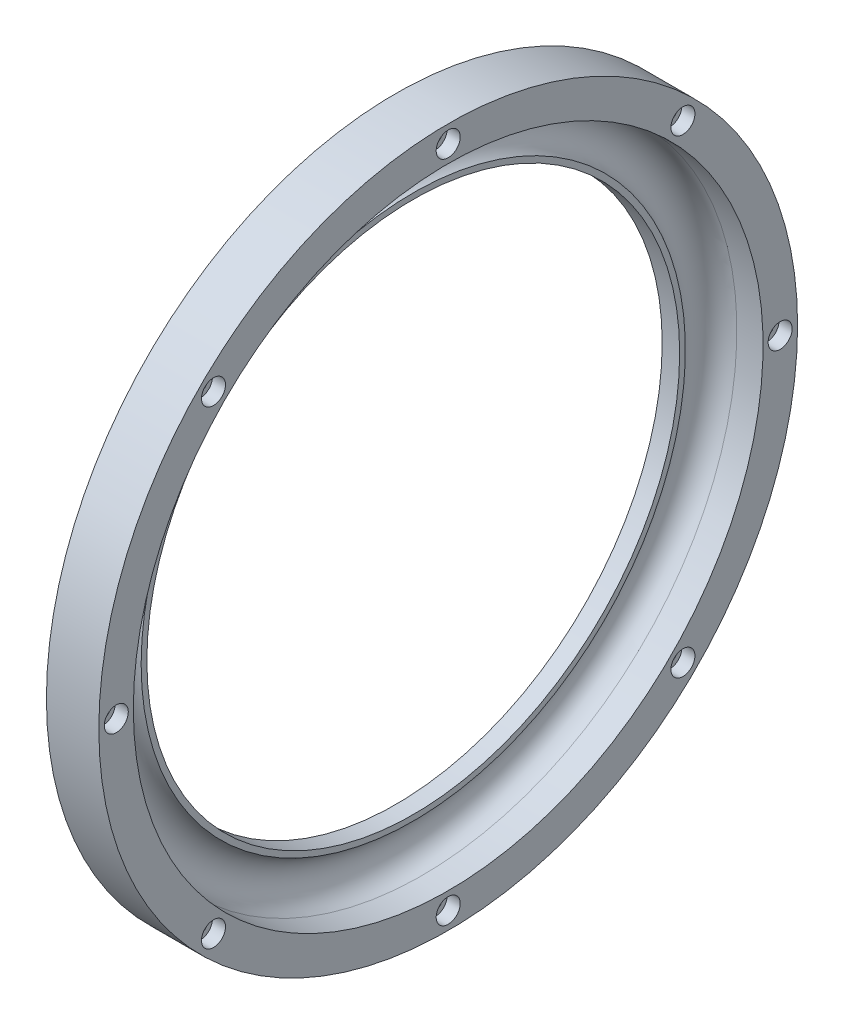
ISO-10303-21;
HEADER;
FILE_DESCRIPTION(('STEP AP214'),'2;1');
FILE_NAME('part.step','',(''),(''),'','','');
FILE_SCHEMA(('AUTOMOTIVE_DESIGN { 1 0 10303 214 1 1 1 1 }'));
ENDSEC;
DATA;
#1=APPLICATION_CONTEXT('core data for automotive mechanical design processes');
#2=APPLICATION_PROTOCOL_DEFINITION('international standard','automotive_design',2000,#1);
#3=PRODUCT_CONTEXT('',#1,'mechanical');
#4=PRODUCT('Part','Part','',(#3));
#5=PRODUCT_RELATED_PRODUCT_CATEGORY('part','',(#4));
#6=PRODUCT_DEFINITION_FORMATION('','',#4);
#7=PRODUCT_DEFINITION_CONTEXT('part definition',#1,'design');
#8=PRODUCT_DEFINITION('design','',#6,#7);
#9=PRODUCT_DEFINITION_SHAPE('','',#8);
#10=(LENGTH_UNIT() NAMED_UNIT(*) SI_UNIT(.MILLI.,.METRE.));
#11=(NAMED_UNIT(*) PLANE_ANGLE_UNIT() SI_UNIT($,.RADIAN.));
#12=(NAMED_UNIT(*) SI_UNIT($,.STERADIAN.) SOLID_ANGLE_UNIT());
#13=UNCERTAINTY_MEASURE_WITH_UNIT(LENGTH_MEASURE(1.E-05),#10,'distance_accuracy_value','');
#14=(GEOMETRIC_REPRESENTATION_CONTEXT(3) GLOBAL_UNCERTAINTY_ASSIGNED_CONTEXT((#13)) GLOBAL_UNIT_ASSIGNED_CONTEXT((#10,
#11,#12)) REPRESENTATION_CONTEXT('',''));
#15=CARTESIAN_POINT('',(0.,0.,0.));
#16=DIRECTION('',(0.,0.,1.));
#17=DIRECTION('',(1.,0.,0.));
#18=AXIS2_PLACEMENT_3D('',#15,#16,#17);
#19=CARTESIAN_POINT('',(-2.18575157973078E-13,53.7401153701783,53.740115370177));
#20=DIRECTION('',(1.,0.,0.));
#21=DIRECTION('',(0.,0.,-1.));
#22=AXIS2_PLACEMENT_3D('',#19,#20,#21);
#23=CYLINDRICAL_SURFACE('',#22,1.6);
#24=CARTESIAN_POINT('',(-2.18575157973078E-13,53.7401153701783,53.740115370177));
#25=DIRECTION('',(1.,0.,0.));
#26=DIRECTION('',(0.,0.,-1.));
#27=AXIS2_PLACEMENT_3D('',#24,#25,#26);
#28=CIRCLE('',#27,1.6);
#29=CARTESIAN_POINT('',(-2.18575157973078E-13,53.7401153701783,52.1401153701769));
#30=VERTEX_POINT('',#29);
#31=EDGE_CURVE('E55',#30,#30,#28,.T.);
#32=ORIENTED_EDGE('',*,*,#31,.F.);
#33=EDGE_LOOP('',(#32));
#34=FACE_BOUND('',#33,.T.);
#35=CARTESIAN_POINT('',(8.99999999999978,53.7401153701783,53.740115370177));
#36=DIRECTION('',(1.,0.,0.));
#37=DIRECTION('',(0.,0.,-1.));
#38=AXIS2_PLACEMENT_3D('',#35,#36,#37);
#39=CIRCLE('',#38,1.6);
#40=CARTESIAN_POINT('',(8.99999999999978,53.7401153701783,52.1401153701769));
#41=VERTEX_POINT('',#40);
#42=EDGE_CURVE('E39',#41,#41,#39,.F.);
#43=ORIENTED_EDGE('',*,*,#42,.F.);
#44=EDGE_LOOP('',(#43));
#45=FACE_BOUND('',#44,.T.);
#46=ADVANCED_FACE('F35',(#34,#45),#23,.F.);
#47=CARTESIAN_POINT('',(-2.18575157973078E-13,-1.09050906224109E-12,75.9999999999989));
#48=DIRECTION('',(1.,0.,0.));
#49=DIRECTION('',(0.,0.,-1.));
#50=AXIS2_PLACEMENT_3D('',#47,#48,#49);
#51=CYLINDRICAL_SURFACE('',#50,1.60000000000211);
#52=CARTESIAN_POINT('',(-2.18575157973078E-13,-1.09050906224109E-12,75.9999999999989));
#53=DIRECTION('',(1.,0.,0.));
#54=DIRECTION('',(0.,0.,-1.));
#55=AXIS2_PLACEMENT_3D('',#52,#53,#54);
#56=CIRCLE('',#55,1.60000000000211);
#57=CARTESIAN_POINT('',(-2.18575157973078E-13,-1.09050906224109E-12,74.3999999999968));
#58=VERTEX_POINT('',#57);
#59=EDGE_CURVE('E124',#58,#58,#56,.T.);
#60=ORIENTED_EDGE('',*,*,#59,.F.);
#61=EDGE_LOOP('',(#60));
#62=FACE_BOUND('',#61,.T.);
#63=CARTESIAN_POINT('',(8.99999999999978,-1.09050906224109E-12,75.9999999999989));
#64=DIRECTION('',(1.,0.,0.));
#65=DIRECTION('',(0.,0.,-1.));
#66=AXIS2_PLACEMENT_3D('',#63,#64,#65);
#67=CIRCLE('',#66,1.60000000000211);
#68=CARTESIAN_POINT('',(8.99999999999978,-1.09050906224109E-12,74.3999999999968));
#69=VERTEX_POINT('',#68);
#70=EDGE_CURVE('E81',#69,#69,#67,.F.);
#71=ORIENTED_EDGE('',*,*,#70,.F.);
#72=EDGE_LOOP('',(#71));
#73=FACE_BOUND('',#72,.T.);
#74=ADVANCED_FACE('F176',(#62,#73),#51,.F.);
#75=CARTESIAN_POINT('',(-2.18575157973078E-13,-53.7401153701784,53.7401153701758));
#76=DIRECTION('',(1.,0.,0.));
#77=DIRECTION('',(0.,0.,-1.));
#78=AXIS2_PLACEMENT_3D('',#75,#76,#77);
#79=CYLINDRICAL_SURFACE('',#78,1.60000000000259);
#80=CARTESIAN_POINT('',(-2.18575157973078E-13,-53.7401153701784,53.7401153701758));
#81=DIRECTION('',(1.,0.,0.));
#82=DIRECTION('',(0.,0.,-1.));
#83=AXIS2_PLACEMENT_3D('',#80,#81,#82);
#84=CIRCLE('',#83,1.60000000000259);
#85=CARTESIAN_POINT('',(-2.18575157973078E-13,-53.7401153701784,52.1401153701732));
#86=VERTEX_POINT('',#85);
#87=EDGE_CURVE('E127',#86,#86,#84,.T.);
#88=ORIENTED_EDGE('',*,*,#87,.F.);
#89=EDGE_LOOP('',(#88));
#90=FACE_BOUND('',#89,.T.);
#91=CARTESIAN_POINT('',(8.99999999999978,-53.7401153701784,53.7401153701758));
#92=DIRECTION('',(1.,0.,0.));
#93=DIRECTION('',(0.,0.,-1.));
#94=AXIS2_PLACEMENT_3D('',#91,#92,#93);
#95=CIRCLE('',#94,1.60000000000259);
#96=CARTESIAN_POINT('',(8.99999999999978,-53.7401153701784,52.1401153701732));
#97=VERTEX_POINT('',#96);
#98=EDGE_CURVE('E77',#97,#97,#95,.F.);
#99=ORIENTED_EDGE('',*,*,#98,.F.);
#100=EDGE_LOOP('',(#99));
#101=FACE_BOUND('',#100,.T.);
#102=ADVANCED_FACE('F182',(#90,#101),#79,.F.);
#103=CARTESIAN_POINT('',(-2.18575157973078E-13,-76.,-2.14716895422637E-12));
#104=DIRECTION('',(1.,0.,0.));
#105=DIRECTION('',(0.,0.,-1.));
#106=AXIS2_PLACEMENT_3D('',#103,#104,#105);
#107=CYLINDRICAL_SURFACE('',#106,1.60000000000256);
#108=CARTESIAN_POINT('',(-2.18575157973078E-13,-76.,-2.14716895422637E-12));
#109=DIRECTION('',(1.,0.,0.));
#110=DIRECTION('',(0.,0.,-1.));
#111=AXIS2_PLACEMENT_3D('',#108,#109,#110);
#112=CIRCLE('',#111,1.60000000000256);
#113=CARTESIAN_POINT('',(-2.18575157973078E-13,-76.,-1.60000000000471));
#114=VERTEX_POINT('',#113);
#115=EDGE_CURVE('E130',#114,#114,#112,.T.);
#116=ORIENTED_EDGE('',*,*,#115,.F.);
#117=EDGE_LOOP('',(#116));
#118=FACE_BOUND('',#117,.T.);
#119=CARTESIAN_POINT('',(8.99999999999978,-76.,-2.14716895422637E-12));
#120=DIRECTION('',(1.,0.,0.));
#121=DIRECTION('',(0.,0.,-1.));
#122=AXIS2_PLACEMENT_3D('',#119,#120,#121);
#123=CIRCLE('',#122,1.60000000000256);
#124=CARTESIAN_POINT('',(8.99999999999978,-76.,-1.60000000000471));
#125=VERTEX_POINT('',#124);
#126=EDGE_CURVE('E72',#125,#125,#123,.F.);
#127=ORIENTED_EDGE('',*,*,#126,.F.);
#128=EDGE_LOOP('',(#127));
#129=FACE_BOUND('',#128,.T.);
#130=ADVANCED_FACE('F193',(#118,#129),#107,.F.);
#131=CARTESIAN_POINT('',(-2.18575157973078E-13,-53.7401153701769,-53.7401153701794));
#132=DIRECTION('',(1.,0.,0.));
#133=DIRECTION('',(0.,0.,-1.));
#134=AXIS2_PLACEMENT_3D('',#131,#132,#133);
#135=CYLINDRICAL_SURFACE('',#134,1.60000000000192);
#136=CARTESIAN_POINT('',(-2.18575157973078E-13,-53.7401153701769,-53.7401153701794));
#137=DIRECTION('',(1.,0.,0.));
#138=DIRECTION('',(0.,0.,-1.));
#139=AXIS2_PLACEMENT_3D('',#136,#137,#138);
#140=CIRCLE('',#139,1.60000000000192);
#141=CARTESIAN_POINT('',(-2.18575157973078E-13,-53.7401153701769,-55.3401153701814));
#142=VERTEX_POINT('',#141);
#143=EDGE_CURVE('E133',#142,#142,#140,.T.);
#144=ORIENTED_EDGE('',*,*,#143,.F.);
#145=EDGE_LOOP('',(#144));
#146=FACE_BOUND('',#145,.T.);
#147=CARTESIAN_POINT('',(8.99999999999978,-53.7401153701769,-53.7401153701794));
#148=DIRECTION('',(1.,0.,0.));
#149=DIRECTION('',(0.,0.,-1.));
#150=AXIS2_PLACEMENT_3D('',#147,#148,#149);
#151=CIRCLE('',#150,1.60000000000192);
#152=CARTESIAN_POINT('',(8.99999999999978,-53.7401153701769,-55.3401153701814));
#153=VERTEX_POINT('',#152);
#154=EDGE_CURVE('E67',#153,#153,#151,.F.);
#155=ORIENTED_EDGE('',*,*,#154,.F.);
#156=EDGE_LOOP('',(#155));
#157=FACE_BOUND('',#156,.T.);
#158=ADVANCED_FACE('F197',(#146,#157),#135,.F.);
#159=CARTESIAN_POINT('',(-2.18575157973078E-13,-2.65352735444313E-13,-76.));
#160=DIRECTION('',(1.,0.,0.));
#161=DIRECTION('',(0.,0.,-1.));
#162=AXIS2_PLACEMENT_3D('',#159,#160,#161);
#163=CYLINDRICAL_SURFACE('',#162,1.6);
#164=CARTESIAN_POINT('',(-2.18575157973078E-13,-2.65352735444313E-13,-76.));
#165=DIRECTION('',(1.,0.,0.));
#166=DIRECTION('',(0.,0.,-1.));
#167=AXIS2_PLACEMENT_3D('',#164,#165,#166);
#168=CIRCLE('',#167,1.6);
#169=CARTESIAN_POINT('',(-2.18575157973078E-13,-2.65352735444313E-13,-77.6));
#170=VERTEX_POINT('',#169);
#171=EDGE_CURVE('E136',#170,#170,#168,.T.);
#172=ORIENTED_EDGE('',*,*,#171,.F.);
#173=EDGE_LOOP('',(#172));
#174=FACE_BOUND('',#173,.T.);
#175=CARTESIAN_POINT('',(8.99999999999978,-2.65352735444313E-13,-76.));
#176=DIRECTION('',(1.,0.,0.));
#177=DIRECTION('',(0.,0.,-1.));
#178=AXIS2_PLACEMENT_3D('',#175,#176,#177);
#179=CIRCLE('',#178,1.6);
#180=CARTESIAN_POINT('',(8.99999999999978,-2.65352735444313E-13,-77.6));
#181=VERTEX_POINT('',#180);
#182=EDGE_CURVE('E62',#181,#181,#179,.F.);
#183=ORIENTED_EDGE('',*,*,#182,.F.);
#184=EDGE_LOOP('',(#183));
#185=FACE_BOUND('',#184,.T.);
#186=ADVANCED_FACE('F201',(#174,#185),#163,.F.);
#187=CARTESIAN_POINT('',(-2.18575157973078E-13,53.7401153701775,-53.7401153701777));
#188=DIRECTION('',(1.,0.,0.));
#189=DIRECTION('',(0.,0.,-1.));
#190=AXIS2_PLACEMENT_3D('',#187,#188,#189);
#191=CYLINDRICAL_SURFACE('',#190,1.6);
#192=CARTESIAN_POINT('',(-2.18575157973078E-13,53.7401153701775,-53.7401153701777));
#193=DIRECTION('',(1.,0.,0.));
#194=DIRECTION('',(0.,0.,-1.));
#195=AXIS2_PLACEMENT_3D('',#192,#193,#194);
#196=CIRCLE('',#195,1.6);
#197=CARTESIAN_POINT('',(-2.18575157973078E-13,53.7401153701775,-55.3401153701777));
#198=VERTEX_POINT('',#197);
#199=EDGE_CURVE('E139',#198,#198,#196,.T.);
#200=ORIENTED_EDGE('',*,*,#199,.F.);
#201=EDGE_LOOP('',(#200));
#202=FACE_BOUND('',#201,.T.);
#203=CARTESIAN_POINT('',(8.99999999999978,53.7401153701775,-53.7401153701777));
#204=DIRECTION('',(1.,0.,0.));
#205=DIRECTION('',(0.,0.,-1.));
#206=AXIS2_PLACEMENT_3D('',#203,#204,#205);
#207=CIRCLE('',#206,1.6);
#208=CARTESIAN_POINT('',(8.99999999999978,53.7401153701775,-55.3401153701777));
#209=VERTEX_POINT('',#208);
#210=EDGE_CURVE('E57',#209,#209,#207,.F.);
#211=ORIENTED_EDGE('',*,*,#210,.F.);
#212=EDGE_LOOP('',(#211));
#213=FACE_BOUND('',#212,.T.);
#214=ADVANCED_FACE('F205',(#202,#213),#191,.F.);
#215=CARTESIAN_POINT('',(-2.18575157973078E-13,76.,0.));
#216=DIRECTION('',(1.,0.,0.));
#217=DIRECTION('',(0.,0.,-1.));
#218=AXIS2_PLACEMENT_3D('',#215,#216,#217);
#219=CYLINDRICAL_SURFACE('',#218,1.6);
#220=CARTESIAN_POINT('',(-2.18575157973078E-13,76.,0.));
#221=DIRECTION('',(1.,0.,0.));
#222=DIRECTION('',(0.,0.,-1.));
#223=AXIS2_PLACEMENT_3D('',#220,#221,#222);
#224=CIRCLE('',#223,1.6);
#225=CARTESIAN_POINT('',(-2.18575157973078E-13,76.,-1.6));
#226=VERTEX_POINT('',#225);
#227=EDGE_CURVE('E142',#226,#226,#224,.T.);
#228=ORIENTED_EDGE('',*,*,#227,.F.);
#229=EDGE_LOOP('',(#228));
#230=FACE_BOUND('',#229,.T.);
#231=CARTESIAN_POINT('',(8.99999999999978,76.,0.));
#232=DIRECTION('',(1.,0.,0.));
#233=DIRECTION('',(0.,0.,-1.));
#234=AXIS2_PLACEMENT_3D('',#231,#232,#233);
#235=CIRCLE('',#234,1.6);
#236=CARTESIAN_POINT('',(8.99999999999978,76.,-1.6));
#237=VERTEX_POINT('',#236);
#238=EDGE_CURVE('E52',#237,#237,#235,.F.);
#239=ORIENTED_EDGE('',*,*,#238,.F.);
#240=EDGE_LOOP('',(#239));
#241=FACE_BOUND('',#240,.T.);
#242=ADVANCED_FACE('F173',(#230,#241),#219,.F.);
#243=CARTESIAN_POINT('',(3.99999999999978,62.3085183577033,0.));
#244=DIRECTION('',(1.,0.,0.));
#245=DIRECTION('',(0.,0.,-1.));
#246=AXIS2_PLACEMENT_3D('',#243,#244,#245);
#247=PLANE('',#246);
#248=CARTESIAN_POINT('',(3.99999999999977,-7.77547884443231E-13,0.));
#249=DIRECTION('',(-1.,0.,0.));
#250=DIRECTION('',(0.,0.,1.));
#251=AXIS2_PLACEMENT_3D('',#248,#249,#250);
#252=CIRCLE('',#251,61.);
#253=CARTESIAN_POINT('',(3.99999999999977,-7.77547884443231E-13,61.));
#254=VERTEX_POINT('',#253);
#255=EDGE_CURVE('E145',#254,#254,#252,.T.);
#256=ORIENTED_EDGE('',*,*,#255,.T.);
#257=EDGE_LOOP('',(#256));
#258=FACE_BOUND('',#257,.T.);
#259=CARTESIAN_POINT('',(3.99999999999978,-7.77547884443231E-13,0.));
#260=DIRECTION('',(-1.,0.,0.));
#261=DIRECTION('',(0.,0.,1.));
#262=AXIS2_PLACEMENT_3D('',#259,#260,#261);
#263=CIRCLE('',#262,62.3085183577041);
#264=CARTESIAN_POINT('',(3.99999999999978,-7.77547884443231E-13,62.3085183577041));
#265=VERTEX_POINT('',#264);
#266=EDGE_CURVE('E10',#265,#265,#263,.T.);
#267=ORIENTED_EDGE('',*,*,#266,.F.);
#268=EDGE_LOOP('',(#267));
#269=FACE_BOUND('',#268,.T.);
#270=ADVANCED_FACE('F37',(#258,#269),#247,.T.);
#271=CARTESIAN_POINT('',(5.99999999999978,-7.7715611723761E-13,0.));
#272=DIRECTION('',(-1.,0.,0.));
#273=DIRECTION('',(0.,0.,1.));
#274=AXIS2_PLACEMENT_3D('',#271,#272,#273);
#275=TOROIDAL_SURFACE('',#274,67.,5.09999999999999);
#276=ORIENTED_EDGE('',*,*,#266,.T.);
#277=EDGE_LOOP('',(#276));
#278=FACE_BOUND('',#277,.T.);
#279=CARTESIAN_POINT('',(5.99999999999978,-7.77547884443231E-13,0.));
#280=DIRECTION('',(-1.,0.,0.));
#281=DIRECTION('',(0.,0.,1.));
#282=AXIS2_PLACEMENT_3D('',#279,#280,#281);
#283=CIRCLE('',#282,72.1);
#284=CARTESIAN_POINT('',(5.99999999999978,-7.77547884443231E-13,72.1));
#285=VERTEX_POINT('',#284);
#286=EDGE_CURVE('E43',#285,#285,#283,.T.);
#287=ORIENTED_EDGE('',*,*,#286,.F.);
#288=EDGE_LOOP('',(#287));
#289=FACE_BOUND('',#288,.T.);
#290=ADVANCED_FACE('F165',(#278,#289),#275,.F.);
#291=CARTESIAN_POINT('',(-7.66444987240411,-7.77547884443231E-13,0.));
#292=DIRECTION('',(-1.,0.,0.));
#293=DIRECTION('',(0.,0.,1.));
#294=AXIS2_PLACEMENT_3D('',#291,#292,#293);
#295=CYLINDRICAL_SURFACE('',#294,72.1);
#296=CARTESIAN_POINT('',(11.9999999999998,-7.77547884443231E-13,0.));
#297=DIRECTION('',(-1.,0.,0.));
#298=DIRECTION('',(0.,0.,1.));
#299=AXIS2_PLACEMENT_3D('',#296,#297,#298);
#300=CIRCLE('',#299,72.1);
#301=CARTESIAN_POINT('',(11.9999999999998,-7.77547884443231E-13,72.1));
#302=VERTEX_POINT('',#301);
#303=EDGE_CURVE('E48',#302,#302,#300,.T.);
#304=ORIENTED_EDGE('',*,*,#303,.F.);
#305=EDGE_LOOP('',(#304));
#306=FACE_BOUND('',#305,.T.);
#307=ORIENTED_EDGE('',*,*,#286,.T.);
#308=EDGE_LOOP('',(#307));
#309=FACE_BOUND('',#308,.T.);
#310=ADVANCED_FACE('F162',(#306,#309),#295,.F.);
#311=CARTESIAN_POINT('',(11.9999999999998,79.9999999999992,0.));
#312=DIRECTION('',(1.,0.,0.));
#313=DIRECTION('',(0.,0.,-1.));
#314=AXIS2_PLACEMENT_3D('',#311,#312,#313);
#315=PLANE('',#314);
#316=CARTESIAN_POINT('',(11.9999999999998,53.7401153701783,53.740115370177));
#317=DIRECTION('',(1.,0.,0.));
#318=DIRECTION('',(0.,0.,-1.));
#319=AXIS2_PLACEMENT_3D('',#316,#317,#318);
#320=CIRCLE('',#319,2.75);
#321=CARTESIAN_POINT('',(11.9999999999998,53.7401153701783,50.990115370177));
#322=VERTEX_POINT('',#321);
#323=EDGE_CURVE('E97',#322,#322,#320,.T.);
#324=ORIENTED_EDGE('',*,*,#323,.F.);
#325=EDGE_LOOP('',(#324));
#326=FACE_BOUND('',#325,.T.);
#327=CARTESIAN_POINT('',(11.9999999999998,-1.09050906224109E-12,75.9999999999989));
#328=DIRECTION('',(1.,0.,0.));
#329=DIRECTION('',(0.,0.,-1.));
#330=AXIS2_PLACEMENT_3D('',#327,#328,#329);
#331=CIRCLE('',#330,2.75000000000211);
#332=CARTESIAN_POINT('',(11.9999999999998,-1.09050906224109E-12,73.2499999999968));
#333=VERTEX_POINT('',#332);
#334=EDGE_CURVE('E90',#333,#333,#331,.T.);
#335=ORIENTED_EDGE('',*,*,#334,.F.);
#336=EDGE_LOOP('',(#335));
#337=FACE_BOUND('',#336,.T.);
#338=CARTESIAN_POINT('',(11.9999999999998,-53.7401153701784,53.7401153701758));
#339=DIRECTION('',(1.,0.,0.));
#340=DIRECTION('',(0.,0.,-1.));
#341=AXIS2_PLACEMENT_3D('',#338,#339,#340);
#342=CIRCLE('',#341,2.75000000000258);
#343=CARTESIAN_POINT('',(11.9999999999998,-53.7401153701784,50.9901153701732));
#344=VERTEX_POINT('',#343);
#345=EDGE_CURVE('E83',#344,#344,#342,.T.);
#346=ORIENTED_EDGE('',*,*,#345,.F.);
#347=EDGE_LOOP('',(#346));
#348=FACE_BOUND('',#347,.T.);
#349=CARTESIAN_POINT('',(11.9999999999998,-76.,-2.14716895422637E-12));
#350=DIRECTION('',(1.,0.,0.));
#351=DIRECTION('',(0.,0.,-1.));
#352=AXIS2_PLACEMENT_3D('',#349,#350,#351);
#353=CIRCLE('',#352,2.75000000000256);
#354=CARTESIAN_POINT('',(11.9999999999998,-76.,-2.75000000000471));
#355=VERTEX_POINT('',#354);
#356=EDGE_CURVE('E79',#355,#355,#353,.T.);
#357=ORIENTED_EDGE('',*,*,#356,.F.);
#358=EDGE_LOOP('',(#357));
#359=FACE_BOUND('',#358,.T.);
#360=CARTESIAN_POINT('',(11.9999999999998,-53.7401153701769,-53.7401153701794));
#361=DIRECTION('',(1.,0.,0.));
#362=DIRECTION('',(0.,0.,-1.));
#363=AXIS2_PLACEMENT_3D('',#360,#361,#362);
#364=CIRCLE('',#363,2.75000000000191);
#365=CARTESIAN_POINT('',(11.9999999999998,-53.7401153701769,-56.4901153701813));
#366=VERTEX_POINT('',#365);
#367=EDGE_CURVE('E75',#366,#366,#364,.T.);
#368=ORIENTED_EDGE('',*,*,#367,.F.);
#369=EDGE_LOOP('',(#368));
#370=FACE_BOUND('',#369,.T.);
#371=CARTESIAN_POINT('',(11.9999999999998,-2.65352735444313E-13,-76.));
#372=DIRECTION('',(1.,0.,0.));
#373=DIRECTION('',(0.,0.,-1.));
#374=AXIS2_PLACEMENT_3D('',#371,#372,#373);
#375=CIRCLE('',#374,2.75);
#376=CARTESIAN_POINT('',(11.9999999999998,-2.65352735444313E-13,-78.75));
#377=VERTEX_POINT('',#376);
#378=EDGE_CURVE('E70',#377,#377,#375,.T.);
#379=ORIENTED_EDGE('',*,*,#378,.F.);
#380=EDGE_LOOP('',(#379));
#381=FACE_BOUND('',#380,.T.);
#382=CARTESIAN_POINT('',(11.9999999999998,53.7401153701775,-53.7401153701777));
#383=DIRECTION('',(1.,0.,0.));
#384=DIRECTION('',(0.,0.,-1.));
#385=AXIS2_PLACEMENT_3D('',#382,#383,#384);
#386=CIRCLE('',#385,2.75);
#387=CARTESIAN_POINT('',(11.9999999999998,53.7401153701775,-56.4901153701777));
#388=VERTEX_POINT('',#387);
#389=EDGE_CURVE('E65',#388,#388,#386,.T.);
#390=ORIENTED_EDGE('',*,*,#389,.F.);
#391=EDGE_LOOP('',(#390));
#392=FACE_BOUND('',#391,.T.);
#393=CARTESIAN_POINT('',(11.9999999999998,76.,0.));
#394=DIRECTION('',(1.,0.,0.));
#395=DIRECTION('',(0.,0.,-1.));
#396=AXIS2_PLACEMENT_3D('',#393,#394,#395);
#397=CIRCLE('',#396,2.75);
#398=CARTESIAN_POINT('',(11.9999999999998,76.,-2.75));
#399=VERTEX_POINT('',#398);
#400=EDGE_CURVE('E60',#399,#399,#397,.T.);
#401=ORIENTED_EDGE('',*,*,#400,.F.);
#402=EDGE_LOOP('',(#401));
#403=FACE_BOUND('',#402,.T.);
#404=ORIENTED_EDGE('',*,*,#303,.T.);
#405=EDGE_LOOP('',(#404));
#406=FACE_BOUND('',#405,.T.);
#407=CARTESIAN_POINT('',(11.9999999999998,-7.77547884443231E-13,0.));
#408=DIRECTION('',(-1.,0.,0.));
#409=DIRECTION('',(0.,0.,1.));
#410=AXIS2_PLACEMENT_3D('',#407,#408,#409);
#411=CIRCLE('',#410,80.);
#412=CARTESIAN_POINT('',(11.9999999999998,-7.77547884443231E-13,80.));
#413=VERTEX_POINT('',#412);
#414=EDGE_CURVE('E154',#413,#413,#411,.T.);
#415=ORIENTED_EDGE('',*,*,#414,.F.);
#416=EDGE_LOOP('',(#415));
#417=FACE_BOUND('',#416,.T.);
#418=ADVANCED_FACE('F159',(#326,#337,#348,#359,#370,#381,#392,#403,#406,#417),#315,.T.);
#419=CARTESIAN_POINT('',(-7.66444987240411,-7.77547884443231E-13,0.));
#420=DIRECTION('',(-1.,0.,0.));
#421=DIRECTION('',(0.,0.,1.));
#422=AXIS2_PLACEMENT_3D('',#419,#420,#421);
#423=CYLINDRICAL_SURFACE('',#422,80.);
#424=ORIENTED_EDGE('',*,*,#414,.T.);
#425=EDGE_LOOP('',(#424));
#426=FACE_BOUND('',#425,.T.);
#427=CARTESIAN_POINT('',(-2.18575157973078E-13,-7.77547884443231E-13,0.));
#428=DIRECTION('',(-1.,0.,0.));
#429=DIRECTION('',(0.,0.,1.));
#430=AXIS2_PLACEMENT_3D('',#427,#428,#429);
#431=CIRCLE('',#430,80.);
#432=CARTESIAN_POINT('',(-2.18575157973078E-13,-7.77547884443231E-13,80.));
#433=VERTEX_POINT('',#432);
#434=EDGE_CURVE('E151',#433,#433,#431,.T.);
#435=ORIENTED_EDGE('',*,*,#434,.F.);
#436=EDGE_LOOP('',(#435));
#437=FACE_BOUND('',#436,.T.);
#438=ADVANCED_FACE('F221',(#426,#437),#423,.T.);
#439=CARTESIAN_POINT('',(-2.19008838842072E-13,60.9999999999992,0.));
#440=DIRECTION('',(-1.,0.,0.));
#441=DIRECTION('',(0.,0.,1.));
#442=AXIS2_PLACEMENT_3D('',#439,#440,#441);
#443=PLANE('',#442);
#444=ORIENTED_EDGE('',*,*,#31,.T.);
#445=EDGE_LOOP('',(#444));
#446=FACE_BOUND('',#445,.T.);
#447=ORIENTED_EDGE('',*,*,#59,.T.);
#448=EDGE_LOOP('',(#447));
#449=FACE_BOUND('',#448,.T.);
#450=ORIENTED_EDGE('',*,*,#87,.T.);
#451=EDGE_LOOP('',(#450));
#452=FACE_BOUND('',#451,.T.);
#453=ORIENTED_EDGE('',*,*,#115,.T.);
#454=EDGE_LOOP('',(#453));
#455=FACE_BOUND('',#454,.T.);
#456=ORIENTED_EDGE('',*,*,#143,.T.);
#457=EDGE_LOOP('',(#456));
#458=FACE_BOUND('',#457,.T.);
#459=ORIENTED_EDGE('',*,*,#171,.T.);
#460=EDGE_LOOP('',(#459));
#461=FACE_BOUND('',#460,.T.);
#462=ORIENTED_EDGE('',*,*,#199,.T.);
#463=EDGE_LOOP('',(#462));
#464=FACE_BOUND('',#463,.T.);
#465=ORIENTED_EDGE('',*,*,#227,.T.);
#466=EDGE_LOOP('',(#465));
#467=FACE_BOUND('',#466,.T.);
#468=ORIENTED_EDGE('',*,*,#434,.T.);
#469=EDGE_LOOP('',(#468));
#470=FACE_BOUND('',#469,.T.);
#471=CARTESIAN_POINT('',(-2.18575157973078E-13,-7.77547884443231E-13,0.));
#472=DIRECTION('',(-1.,0.,0.));
#473=DIRECTION('',(0.,0.,1.));
#474=AXIS2_PLACEMENT_3D('',#471,#472,#473);
#475=CIRCLE('',#474,61.);
#476=CARTESIAN_POINT('',(-2.18575157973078E-13,-7.77547884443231E-13,61.));
#477=VERTEX_POINT('',#476);
#478=EDGE_CURVE('E148',#477,#477,#475,.T.);
#479=ORIENTED_EDGE('',*,*,#478,.F.);
#480=EDGE_LOOP('',(#479));
#481=FACE_BOUND('',#480,.T.);
#482=ADVANCED_FACE('F217',(#446,#449,#452,#455,#458,#461,#464,#467,#470,#481),#443,.T.);
#483=CARTESIAN_POINT('',(-7.66444987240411,-7.77547884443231E-13,0.));
#484=DIRECTION('',(-1.,0.,0.));
#485=DIRECTION('',(0.,0.,1.));
#486=AXIS2_PLACEMENT_3D('',#483,#484,#485);
#487=CYLINDRICAL_SURFACE('',#486,61.);
#488=ORIENTED_EDGE('',*,*,#478,.T.);
#489=EDGE_LOOP('',(#488));
#490=FACE_BOUND('',#489,.T.);
#491=ORIENTED_EDGE('',*,*,#255,.F.);
#492=EDGE_LOOP('',(#491));
#493=FACE_BOUND('',#492,.T.);
#494=ADVANCED_FACE('F213',(#490,#493),#487,.F.);
#495=CARTESIAN_POINT('',(8.99999999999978,76.,0.));
#496=DIRECTION('',(1.,0.,0.));
#497=DIRECTION('',(0.,0.,-1.));
#498=AXIS2_PLACEMENT_3D('',#495,#496,#497);
#499=PLANE('',#498);
#500=CARTESIAN_POINT('',(8.99999999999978,76.,0.));
#501=DIRECTION('',(1.,0.,0.));
#502=DIRECTION('',(0.,0.,-1.));
#503=AXIS2_PLACEMENT_3D('',#500,#501,#502);
#504=CIRCLE('',#503,2.75);
#505=CARTESIAN_POINT('',(8.99999999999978,76.,-2.75));
#506=VERTEX_POINT('',#505);
#507=EDGE_CURVE('E56',#506,#506,#504,.T.);
#508=ORIENTED_EDGE('',*,*,#507,.T.);
#509=EDGE_LOOP('',(#508));
#510=FACE_BOUND('',#509,.T.);
#511=ORIENTED_EDGE('',*,*,#238,.T.);
#512=EDGE_LOOP('',(#511));
#513=FACE_BOUND('',#512,.T.);
#514=ADVANCED_FACE('F216',(#510,#513),#499,.T.);
#515=CARTESIAN_POINT('',(8.99999999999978,76.,0.));
#516=DIRECTION('',(1.,0.,0.));
#517=DIRECTION('',(0.,0.,-1.));
#518=AXIS2_PLACEMENT_3D('',#515,#516,#517);
#519=CYLINDRICAL_SURFACE('',#518,2.75);
#520=ORIENTED_EDGE('',*,*,#507,.F.);
#521=EDGE_LOOP('',(#520));
#522=FACE_BOUND('',#521,.T.);
#523=ORIENTED_EDGE('',*,*,#400,.T.);
#524=EDGE_LOOP('',(#523));
#525=FACE_BOUND('',#524,.T.);
#526=ADVANCED_FACE('F188',(#522,#525),#519,.F.);
#527=CARTESIAN_POINT('',(8.99999999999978,53.7401153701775,-53.7401153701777));
#528=DIRECTION('',(1.,0.,0.));
#529=DIRECTION('',(0.,0.,-1.));
#530=AXIS2_PLACEMENT_3D('',#527,#528,#529);
#531=PLANE('',#530);
#532=CARTESIAN_POINT('',(8.99999999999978,53.7401153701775,-53.7401153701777));
#533=DIRECTION('',(1.,0.,0.));
#534=DIRECTION('',(0.,0.,-1.));
#535=AXIS2_PLACEMENT_3D('',#532,#533,#534);
#536=CIRCLE('',#535,2.75);
#537=CARTESIAN_POINT('',(8.99999999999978,53.7401153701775,-56.4901153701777));
#538=VERTEX_POINT('',#537);
#539=EDGE_CURVE('E61',#538,#538,#536,.T.);
#540=ORIENTED_EDGE('',*,*,#539,.T.);
#541=EDGE_LOOP('',(#540));
#542=FACE_BOUND('',#541,.T.);
#543=ORIENTED_EDGE('',*,*,#210,.T.);
#544=EDGE_LOOP('',(#543));
#545=FACE_BOUND('',#544,.T.);
#546=ADVANCED_FACE('F248',(#542,#545),#531,.T.);
#547=CARTESIAN_POINT('',(8.99999999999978,53.7401153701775,-53.7401153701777));
#548=DIRECTION('',(1.,0.,0.));
#549=DIRECTION('',(0.,0.,-1.));
#550=AXIS2_PLACEMENT_3D('',#547,#548,#549);
#551=CYLINDRICAL_SURFACE('',#550,2.75);
#552=ORIENTED_EDGE('',*,*,#539,.F.);
#553=EDGE_LOOP('',(#552));
#554=FACE_BOUND('',#553,.T.);
#555=ORIENTED_EDGE('',*,*,#389,.T.);
#556=EDGE_LOOP('',(#555));
#557=FACE_BOUND('',#556,.T.);
#558=ADVANCED_FACE('F254',(#554,#557),#551,.F.);
#559=CARTESIAN_POINT('',(8.99999999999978,-2.65352735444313E-13,-76.));
#560=DIRECTION('',(1.,0.,0.));
#561=DIRECTION('',(0.,0.,-1.));
#562=AXIS2_PLACEMENT_3D('',#559,#560,#561);
#563=PLANE('',#562);
#564=CARTESIAN_POINT('',(8.99999999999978,-2.65352735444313E-13,-76.));
#565=DIRECTION('',(1.,0.,0.));
#566=DIRECTION('',(0.,0.,-1.));
#567=AXIS2_PLACEMENT_3D('',#564,#565,#566);
#568=CIRCLE('',#567,2.75);
#569=CARTESIAN_POINT('',(8.99999999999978,-2.65352735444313E-13,-78.75));
#570=VERTEX_POINT('',#569);
#571=EDGE_CURVE('E66',#570,#570,#568,.T.);
#572=ORIENTED_EDGE('',*,*,#571,.T.);
#573=EDGE_LOOP('',(#572));
#574=FACE_BOUND('',#573,.T.);
#575=ORIENTED_EDGE('',*,*,#182,.T.);
#576=EDGE_LOOP('',(#575));
#577=FACE_BOUND('',#576,.T.);
#578=ADVANCED_FACE('F266',(#574,#577),#563,.T.);
#579=CARTESIAN_POINT('',(8.99999999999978,-2.65352735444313E-13,-76.));
#580=DIRECTION('',(1.,0.,0.));
#581=DIRECTION('',(0.,0.,-1.));
#582=AXIS2_PLACEMENT_3D('',#579,#580,#581);
#583=CYLINDRICAL_SURFACE('',#582,2.75);
#584=ORIENTED_EDGE('',*,*,#571,.F.);
#585=EDGE_LOOP('',(#584));
#586=FACE_BOUND('',#585,.T.);
#587=ORIENTED_EDGE('',*,*,#378,.T.);
#588=EDGE_LOOP('',(#587));
#589=FACE_BOUND('',#588,.T.);
#590=ADVANCED_FACE('F269',(#586,#589),#583,.F.);
#591=CARTESIAN_POINT('',(8.99999999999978,-53.7401153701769,-53.7401153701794));
#592=DIRECTION('',(1.,0.,0.));
#593=DIRECTION('',(0.,0.,-1.));
#594=AXIS2_PLACEMENT_3D('',#591,#592,#593);
#595=PLANE('',#594);
#596=CARTESIAN_POINT('',(8.99999999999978,-53.7401153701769,-53.7401153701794));
#597=DIRECTION('',(1.,0.,0.));
#598=DIRECTION('',(0.,0.,-1.));
#599=AXIS2_PLACEMENT_3D('',#596,#597,#598);
#600=CIRCLE('',#599,2.75000000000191);
#601=CARTESIAN_POINT('',(8.99999999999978,-53.7401153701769,-56.4901153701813));
#602=VERTEX_POINT('',#601);
#603=EDGE_CURVE('E71',#602,#602,#600,.T.);
#604=ORIENTED_EDGE('',*,*,#603,.T.);
#605=EDGE_LOOP('',(#604));
#606=FACE_BOUND('',#605,.T.);
#607=ORIENTED_EDGE('',*,*,#154,.T.);
#608=EDGE_LOOP('',(#607));
#609=FACE_BOUND('',#608,.T.);
#610=ADVANCED_FACE('F272',(#606,#609),#595,.T.);
#611=CARTESIAN_POINT('',(8.99999999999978,-53.7401153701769,-53.7401153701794));
#612=DIRECTION('',(1.,0.,0.));
#613=DIRECTION('',(0.,0.,-1.));
#614=AXIS2_PLACEMENT_3D('',#611,#612,#613);
#615=CYLINDRICAL_SURFACE('',#614,2.75000000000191);
#616=ORIENTED_EDGE('',*,*,#603,.F.);
#617=EDGE_LOOP('',(#616));
#618=FACE_BOUND('',#617,.T.);
#619=ORIENTED_EDGE('',*,*,#367,.T.);
#620=EDGE_LOOP('',(#619));
#621=FACE_BOUND('',#620,.T.);
#622=ADVANCED_FACE('F277',(#618,#621),#615,.F.);
#623=CARTESIAN_POINT('',(8.99999999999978,-76.,-2.14716895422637E-12));
#624=DIRECTION('',(1.,0.,0.));
#625=DIRECTION('',(0.,0.,-1.));
#626=AXIS2_PLACEMENT_3D('',#623,#624,#625);
#627=PLANE('',#626);
#628=CARTESIAN_POINT('',(8.99999999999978,-76.,-2.14716895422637E-12));
#629=DIRECTION('',(1.,0.,0.));
#630=DIRECTION('',(0.,0.,-1.));
#631=AXIS2_PLACEMENT_3D('',#628,#629,#630);
#632=CIRCLE('',#631,2.75000000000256);
#633=CARTESIAN_POINT('',(8.99999999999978,-76.,-2.75000000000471));
#634=VERTEX_POINT('',#633);
#635=EDGE_CURVE('E76',#634,#634,#632,.T.);
#636=ORIENTED_EDGE('',*,*,#635,.T.);
#637=EDGE_LOOP('',(#636));
#638=FACE_BOUND('',#637,.T.);
#639=ORIENTED_EDGE('',*,*,#126,.T.);
#640=EDGE_LOOP('',(#639));
#641=FACE_BOUND('',#640,.T.);
#642=ADVANCED_FACE('F280',(#638,#641),#627,.T.);
#643=CARTESIAN_POINT('',(8.99999999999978,-76.,-2.14716895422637E-12));
#644=DIRECTION('',(1.,0.,0.));
#645=DIRECTION('',(0.,0.,-1.));
#646=AXIS2_PLACEMENT_3D('',#643,#644,#645);
#647=CYLINDRICAL_SURFACE('',#646,2.75000000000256);
#648=ORIENTED_EDGE('',*,*,#635,.F.);
#649=EDGE_LOOP('',(#648));
#650=FACE_BOUND('',#649,.T.);
#651=ORIENTED_EDGE('',*,*,#356,.T.);
#652=EDGE_LOOP('',(#651));
#653=FACE_BOUND('',#652,.T.);
#654=ADVANCED_FACE('F285',(#650,#653),#647,.F.);
#655=CARTESIAN_POINT('',(8.99999999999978,-53.7401153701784,53.7401153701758));
#656=DIRECTION('',(1.,0.,0.));
#657=DIRECTION('',(0.,0.,-1.));
#658=AXIS2_PLACEMENT_3D('',#655,#656,#657);
#659=PLANE('',#658);
#660=CARTESIAN_POINT('',(8.99999999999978,-53.7401153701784,53.7401153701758));
#661=DIRECTION('',(1.,0.,0.));
#662=DIRECTION('',(0.,0.,-1.));
#663=AXIS2_PLACEMENT_3D('',#660,#661,#662);
#664=CIRCLE('',#663,2.75000000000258);
#665=CARTESIAN_POINT('',(8.99999999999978,-53.7401153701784,50.9901153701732));
#666=VERTEX_POINT('',#665);
#667=EDGE_CURVE('E80',#666,#666,#664,.T.);
#668=ORIENTED_EDGE('',*,*,#667,.T.);
#669=EDGE_LOOP('',(#668));
#670=FACE_BOUND('',#669,.T.);
#671=ORIENTED_EDGE('',*,*,#98,.T.);
#672=EDGE_LOOP('',(#671));
#673=FACE_BOUND('',#672,.T.);
#674=ADVANCED_FACE('F288',(#670,#673),#659,.T.);
#675=CARTESIAN_POINT('',(8.99999999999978,-53.7401153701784,53.7401153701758));
#676=DIRECTION('',(1.,0.,0.));
#677=DIRECTION('',(0.,0.,-1.));
#678=AXIS2_PLACEMENT_3D('',#675,#676,#677);
#679=CYLINDRICAL_SURFACE('',#678,2.75000000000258);
#680=ORIENTED_EDGE('',*,*,#667,.F.);
#681=EDGE_LOOP('',(#680));
#682=FACE_BOUND('',#681,.T.);
#683=ORIENTED_EDGE('',*,*,#345,.T.);
#684=EDGE_LOOP('',(#683));
#685=FACE_BOUND('',#684,.T.);
#686=ADVANCED_FACE('F293',(#682,#685),#679,.F.);
#687=CARTESIAN_POINT('',(8.99999999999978,-1.09050906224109E-12,75.9999999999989));
#688=DIRECTION('',(1.,0.,0.));
#689=DIRECTION('',(0.,0.,-1.));
#690=AXIS2_PLACEMENT_3D('',#687,#688,#689);
#691=PLANE('',#690);
#692=CARTESIAN_POINT('',(8.99999999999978,-1.09050906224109E-12,75.9999999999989));
#693=DIRECTION('',(1.,0.,0.));
#694=DIRECTION('',(0.,0.,-1.));
#695=AXIS2_PLACEMENT_3D('',#692,#693,#694);
#696=CIRCLE('',#695,2.75000000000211);
#697=CARTESIAN_POINT('',(8.99999999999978,-1.09050906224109E-12,73.2499999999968));
#698=VERTEX_POINT('',#697);
#699=EDGE_CURVE('E84',#698,#698,#696,.T.);
#700=ORIENTED_EDGE('',*,*,#699,.T.);
#701=EDGE_LOOP('',(#700));
#702=FACE_BOUND('',#701,.T.);
#703=ORIENTED_EDGE('',*,*,#70,.T.);
#704=EDGE_LOOP('',(#703));
#705=FACE_BOUND('',#704,.T.);
#706=ADVANCED_FACE('F296',(#702,#705),#691,.T.);
#707=CARTESIAN_POINT('',(8.99999999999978,-1.09050906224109E-12,75.9999999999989));
#708=DIRECTION('',(1.,0.,0.));
#709=DIRECTION('',(0.,0.,-1.));
#710=AXIS2_PLACEMENT_3D('',#707,#708,#709);
#711=CYLINDRICAL_SURFACE('',#710,2.75000000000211);
#712=ORIENTED_EDGE('',*,*,#699,.F.);
#713=EDGE_LOOP('',(#712));
#714=FACE_BOUND('',#713,.T.);
#715=ORIENTED_EDGE('',*,*,#334,.T.);
#716=EDGE_LOOP('',(#715));
#717=FACE_BOUND('',#716,.T.);
#718=ADVANCED_FACE('F301',(#714,#717),#711,.F.);
#719=CARTESIAN_POINT('',(8.99999999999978,53.7401153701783,53.740115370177));
#720=DIRECTION('',(1.,0.,0.));
#721=DIRECTION('',(0.,0.,-1.));
#722=AXIS2_PLACEMENT_3D('',#719,#720,#721);
#723=PLANE('',#722);
#724=CARTESIAN_POINT('',(8.99999999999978,53.7401153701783,53.740115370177));
#725=DIRECTION('',(1.,0.,0.));
#726=DIRECTION('',(0.,0.,-1.));
#727=AXIS2_PLACEMENT_3D('',#724,#725,#726);
#728=CIRCLE('',#727,2.75);
#729=CARTESIAN_POINT('',(8.99999999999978,53.7401153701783,50.990115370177));
#730=VERTEX_POINT('',#729);
#731=EDGE_CURVE('E319',#730,#730,#728,.T.);
#732=ORIENTED_EDGE('',*,*,#731,.T.);
#733=EDGE_LOOP('',(#732));
#734=FACE_BOUND('',#733,.T.);
#735=ORIENTED_EDGE('',*,*,#42,.T.);
#736=EDGE_LOOP('',(#735));
#737=FACE_BOUND('',#736,.T.);
#738=ADVANCED_FACE('F304',(#734,#737),#723,.T.);
#739=CARTESIAN_POINT('',(8.99999999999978,53.7401153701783,53.740115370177));
#740=DIRECTION('',(1.,0.,0.));
#741=DIRECTION('',(0.,0.,-1.));
#742=AXIS2_PLACEMENT_3D('',#739,#740,#741);
#743=CYLINDRICAL_SURFACE('',#742,2.75);
#744=ORIENTED_EDGE('',*,*,#731,.F.);
#745=EDGE_LOOP('',(#744));
#746=FACE_BOUND('',#745,.T.);
#747=ORIENTED_EDGE('',*,*,#323,.T.);
#748=EDGE_LOOP('',(#747));
#749=FACE_BOUND('',#748,.T.);
#750=ADVANCED_FACE('F308',(#746,#749),#743,.F.);
#751=CLOSED_SHELL('',(#46,#74,#102,#130,#158,#186,#214,#242,#270,#290,#310,#418,#438,#482,#494,
#514,#526,#546,#558,#578,#590,#610,#622,#642,#654,#674,#686,#706,#718,#738,#750));
#752=MANIFOLD_SOLID_BREP('B2',#751);
#753=ADVANCED_BREP_SHAPE_REPRESENTATION('',(#18,#752),#14);
#754=SHAPE_DEFINITION_REPRESENTATION(#9,#753);
ENDSEC;
END-ISO-10303-21;
